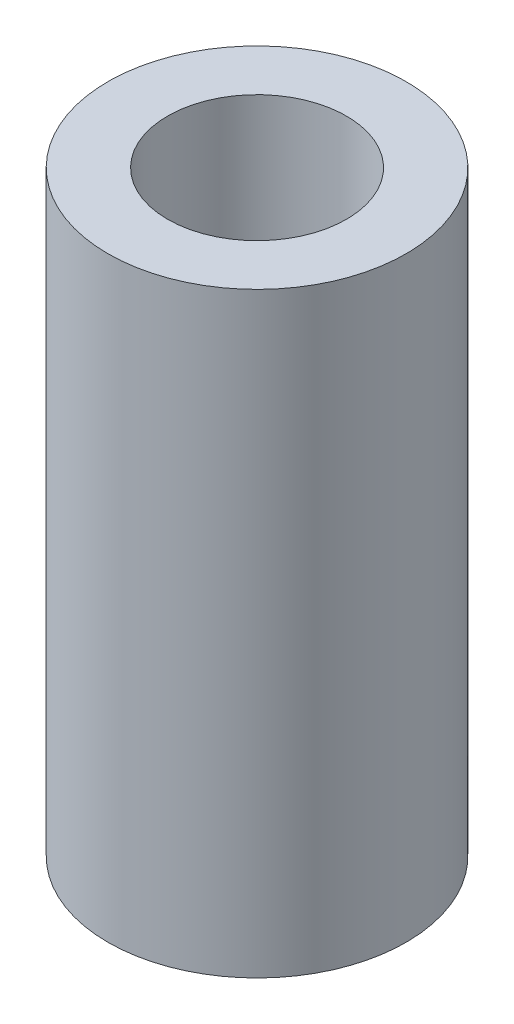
from build123d import *

# Parameters (mm, degrees)
SKETCH1_R           = 2.5
SKETCH1_R_2         = 1.5
BOSS_EXTRUDE1_DEPTH = 10


with BuildPart() as part:
    # Sketch1 → Boss-Extrude1 (new body)
    with BuildSketch(Plane(origin=(0, 0, 0), x_dir=(1, 0, 0), z_dir=(0, 1, 0))):
        with Locations(Location((0, 0, 0), (0, 0, 270))):
            Circle(SKETCH1_R)
        with Locations(Location((0, 0, 0), (0, 0, 270))):
            Circle(SKETCH1_R_2, mode=Mode.SUBTRACT)
    extrude(amount=BOSS_EXTRUDE1_DEPTH)


solid = part.part
